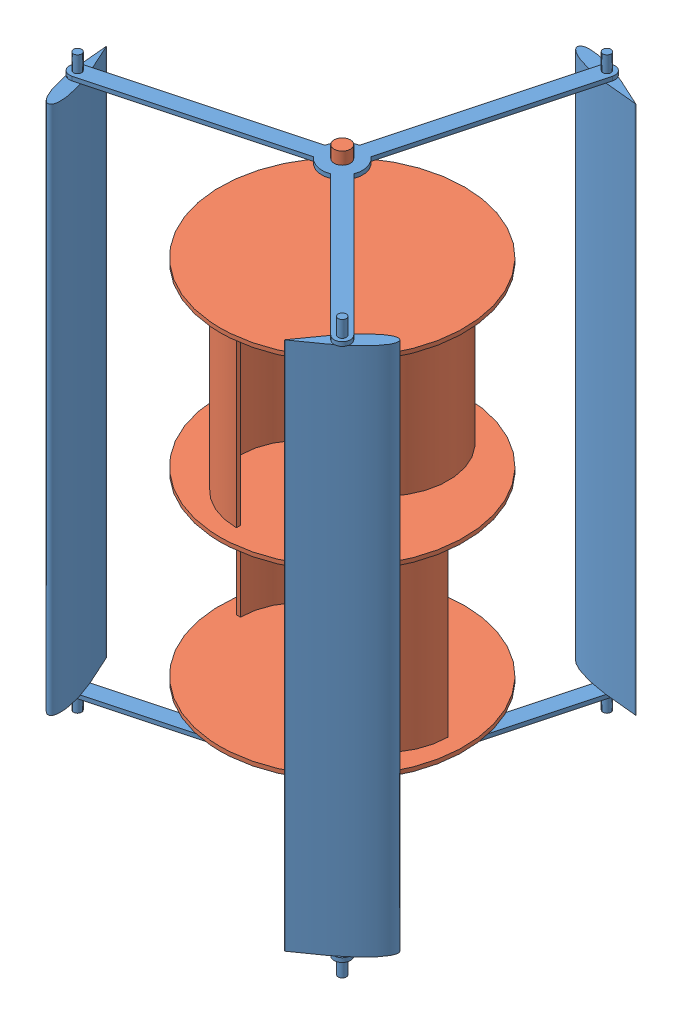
SolidWorks assembly Assem1.SLDASM, configuration Default (file format 9000). Lengths in mm.
Overall size (493.45 700 496.4).
2 component instances, 2 part files, 2 mates.
Components (placement in the parent):
- darious-1: darious.SLDPRT [Default] at (231.892 30.2169 516.3493) x (0 0 1) z (0 1 0) size (496.4 493.45 700)
- savonius-1: savonius.SLDPRT [Default] at (231.892 130.2169 516.3493) size (300 680 300)
Mates (geometry in assembly coordinates):
- Concentric1: concentric anti-aligned: cylinder of darious-1 through (231.892 25.2169 516.3493) axis (0 1 0) radius 10; cylinder of savonius-1 through (231.892 570.2169 516.3493) axis (0 -1 0) radius 10
- Width1: width anti-aligned: plane of darious-1 through (231.892 680.2169 516.3493) normal (0 -1 0); plane of darious-1 through (231.892 30.2169 516.3493) normal (0 1 0); plane of savonius-1 through (231.892 580.2169 516.3493) normal (0 1 0); plane of savonius-1 through (231.892 130.2169 516.3493) normal (0 -1 0)
